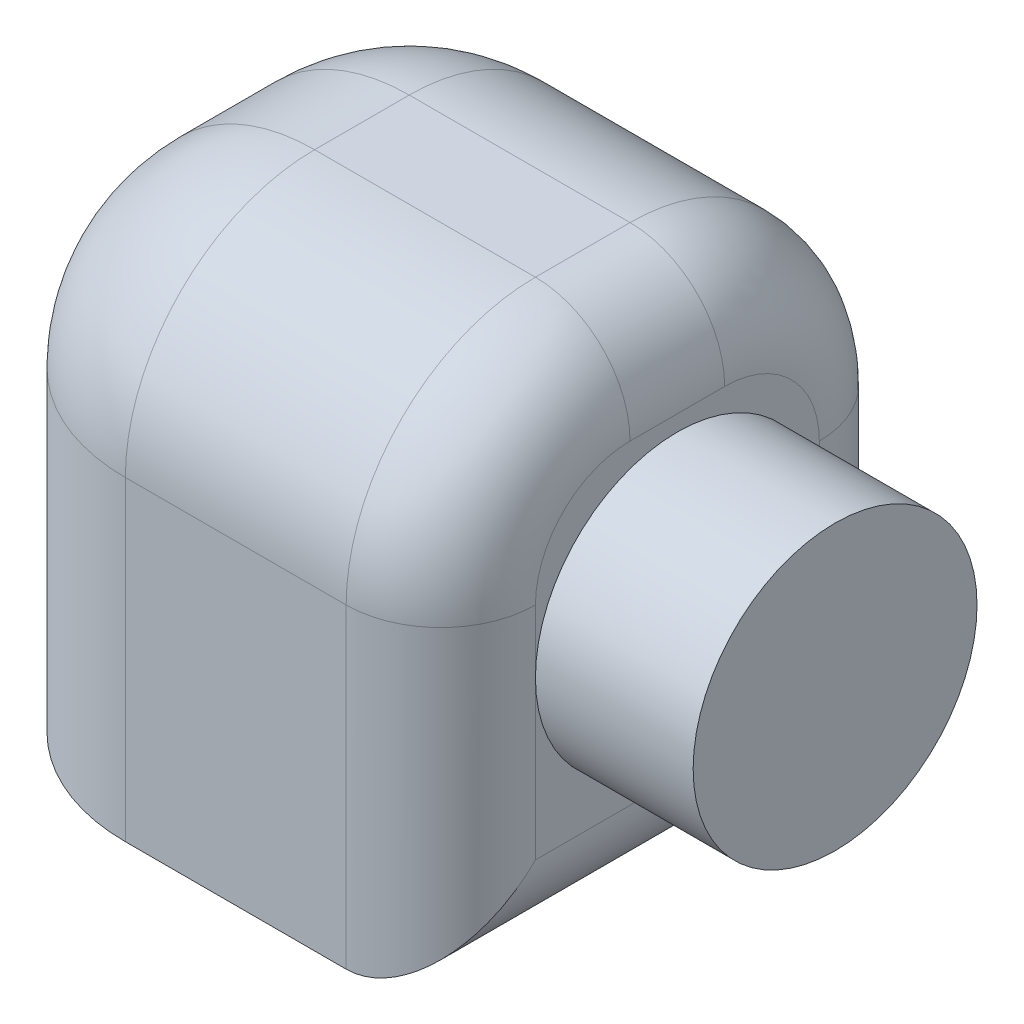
ISO-10303-21;
HEADER;
FILE_DESCRIPTION(('STEP AP214'),'2;1');
FILE_NAME('part.step','',(''),(''),'','','');
FILE_SCHEMA(('AUTOMOTIVE_DESIGN { 1 0 10303 214 1 1 1 1 }'));
ENDSEC;
DATA;
#1=APPLICATION_CONTEXT('core data for automotive mechanical design processes');
#2=APPLICATION_PROTOCOL_DEFINITION('international standard','automotive_design',2000,#1);
#3=PRODUCT_CONTEXT('',#1,'mechanical');
#4=PRODUCT('Part','Part','',(#3));
#5=PRODUCT_RELATED_PRODUCT_CATEGORY('part','',(#4));
#6=PRODUCT_DEFINITION_FORMATION('','',#4);
#7=PRODUCT_DEFINITION_CONTEXT('part definition',#1,'design');
#8=PRODUCT_DEFINITION('design','',#6,#7);
#9=PRODUCT_DEFINITION_SHAPE('','',#8);
#10=(LENGTH_UNIT() NAMED_UNIT(*) SI_UNIT(.MILLI.,.METRE.));
#11=(NAMED_UNIT(*) PLANE_ANGLE_UNIT() SI_UNIT($,.RADIAN.));
#12=(NAMED_UNIT(*) SI_UNIT($,.STERADIAN.) SOLID_ANGLE_UNIT());
#13=UNCERTAINTY_MEASURE_WITH_UNIT(LENGTH_MEASURE(1.E-05),#10,'distance_accuracy_value','');
#14=(GEOMETRIC_REPRESENTATION_CONTEXT(3) GLOBAL_UNCERTAINTY_ASSIGNED_CONTEXT((#13)) GLOBAL_UNIT_ASSIGNED_CONTEXT((#10,
#11,#12)) REPRESENTATION_CONTEXT('',''));
#15=CARTESIAN_POINT('',(0.,0.,0.));
#16=DIRECTION('',(0.,0.,1.));
#17=DIRECTION('',(1.,0.,0.));
#18=AXIS2_PLACEMENT_3D('',#15,#16,#17);
#19=CARTESIAN_POINT('',(160.,160.,0.));
#20=DIRECTION('',(-1.,0.,0.));
#21=DIRECTION('',(0.,0.,1.));
#22=AXIS2_PLACEMENT_3D('',#19,#20,#21);
#23=PLANE('',#22);
#24=CARTESIAN_POINT('',(160.,80.,-75.));
#25=DIRECTION('',(1.,0.,0.));
#26=DIRECTION('',(0.,0.,-1.));
#27=AXIS2_PLACEMENT_3D('',#24,#25,#26);
#28=CIRCLE('',#27,45.);
#29=CARTESIAN_POINT('',(160.,80.,-30.));
#30=VERTEX_POINT('',#29);
#31=CARTESIAN_POINT('',(160.,80.,-120.));
#32=VERTEX_POINT('',#31);
#33=EDGE_CURVE('E250',#30,#32,#28,.T.);
#34=ORIENTED_EDGE('',*,*,#33,.F.);
#35=DIRECTION('',(0.,-1.,0.));
#36=VECTOR('',#35,1.);
#37=CARTESIAN_POINT('',(160.,160.,-30.));
#38=LINE('',#37,#36);
#39=CARTESIAN_POINT('',(160.,30.,-30.));
#40=VERTEX_POINT('',#39);
#41=EDGE_CURVE('E206',#30,#40,#38,.T.);
#42=ORIENTED_EDGE('',*,*,#41,.T.);
#43=DIRECTION('',(0.,0.,-1.));
#44=VECTOR('',#43,1.);
#45=CARTESIAN_POINT('',(160.,30.,-150.));
#46=LINE('',#45,#44);
#47=CARTESIAN_POINT('',(160.,30.,-120.));
#48=VERTEX_POINT('',#47);
#49=EDGE_CURVE('E178',#40,#48,#46,.T.);
#50=ORIENTED_EDGE('',*,*,#49,.T.);
#51=DIRECTION('',(0.,-1.,0.));
#52=VECTOR('',#51,1.);
#53=CARTESIAN_POINT('',(160.,160.,-120.));
#54=LINE('',#53,#52);
#55=EDGE_CURVE('E195',#48,#32,#54,.F.);
#56=ORIENTED_EDGE('',*,*,#55,.T.);
#57=EDGE_LOOP('',(#34,#42,#50,#56));
#58=FACE_BOUND('',#57,.T.);
#59=ADVANCED_FACE('F36',(#58),#23,.F.);
#60=CARTESIAN_POINT('',(0.,160.,0.));
#61=DIRECTION('',(1.,0.,0.));
#62=DIRECTION('',(0.,0.,-1.));
#63=AXIS2_PLACEMENT_3D('',#60,#61,#62);
#64=PLANE('',#63);
#65=DIRECTION('',(0.,0.,1.));
#66=VECTOR('',#65,1.);
#67=CARTESIAN_POINT('',(0.,100.,0.));
#68=LINE('',#67,#66);
#69=CARTESIAN_POINT('',(0.,100.,-60.));
#70=VERTEX_POINT('',#69);
#71=CARTESIAN_POINT('',(0.,100.,-90.));
#72=VERTEX_POINT('',#71);
#73=EDGE_CURVE('E136',#70,#72,#68,.F.);
#74=ORIENTED_EDGE('',*,*,#73,.T.);
#75=DIRECTION('',(0.,-1.,0.));
#76=VECTOR('',#75,1.);
#77=CARTESIAN_POINT('',(0.,160.,-90.));
#78=LINE('',#77,#76);
#79=CARTESIAN_POINT('',(0.,0.,-90.));
#80=VERTEX_POINT('',#79);
#81=EDGE_CURVE('E164',#72,#80,#78,.T.);
#82=ORIENTED_EDGE('',*,*,#81,.T.);
#83=DIRECTION('',(0.,0.,1.));
#84=VECTOR('',#83,1.);
#85=CARTESIAN_POINT('',(0.,0.,0.));
#86=LINE('',#85,#84);
#87=CARTESIAN_POINT('',(0.,0.,-60.));
#88=VERTEX_POINT('',#87);
#89=EDGE_CURVE('E280',#80,#88,#86,.T.);
#90=ORIENTED_EDGE('',*,*,#89,.T.);
#91=DIRECTION('',(0.,-1.,0.));
#92=VECTOR('',#91,1.);
#93=CARTESIAN_POINT('',(0.,160.,-60.));
#94=LINE('',#93,#92);
#95=EDGE_CURVE('E158',#88,#70,#94,.F.);
#96=ORIENTED_EDGE('',*,*,#95,.T.);
#97=EDGE_LOOP('',(#74,#82,#90,#96));
#98=FACE_BOUND('',#97,.T.);
#99=ADVANCED_FACE('F279',(#98),#64,.F.);
#100=CARTESIAN_POINT('',(0.,160.,0.));
#101=DIRECTION('',(0.,0.,-1.));
#102=DIRECTION('',(-1.,0.,0.));
#103=AXIS2_PLACEMENT_3D('',#100,#101,#102);
#104=PLANE('',#103);
#105=DIRECTION('',(1.,0.,0.));
#106=VECTOR('',#105,1.);
#107=CARTESIAN_POINT('',(0.,0.,0.));
#108=LINE('',#107,#106);
#109=CARTESIAN_POINT('',(60.,0.,0.));
#110=VERTEX_POINT('',#109);
#111=CARTESIAN_POINT('',(130.,0.,0.));
#112=VERTEX_POINT('',#111);
#113=EDGE_CURVE('E251',#110,#112,#108,.T.);
#114=ORIENTED_EDGE('',*,*,#113,.T.);
#115=DIRECTION('',(0.,-1.,0.));
#116=VECTOR('',#115,1.);
#117=CARTESIAN_POINT('',(130.,160.,0.));
#118=LINE('',#117,#116);
#119=CARTESIAN_POINT('',(130.,100.,0.));
#120=VERTEX_POINT('',#119);
#121=EDGE_CURVE('E212',#112,#120,#118,.F.);
#122=ORIENTED_EDGE('',*,*,#121,.T.);
#123=DIRECTION('',(1.,0.,0.));
#124=VECTOR('',#123,1.);
#125=CARTESIAN_POINT('',(0.,100.,0.));
#126=LINE('',#125,#124);
#127=CARTESIAN_POINT('',(60.,100.,0.));
#128=VERTEX_POINT('',#127);
#129=EDGE_CURVE('E177',#120,#128,#126,.F.);
#130=ORIENTED_EDGE('',*,*,#129,.T.);
#131=DIRECTION('',(0.,-1.,0.));
#132=VECTOR('',#131,1.);
#133=CARTESIAN_POINT('',(60.,160.,0.));
#134=LINE('',#133,#132);
#135=EDGE_CURVE('E175',#128,#110,#134,.T.);
#136=ORIENTED_EDGE('',*,*,#135,.T.);
#137=EDGE_LOOP('',(#114,#122,#130,#136));
#138=FACE_BOUND('',#137,.T.);
#139=ADVANCED_FACE('F262',(#138),#104,.F.);
#140=CARTESIAN_POINT('',(160.,100.,-60.));
#141=DIRECTION('',(-1.,0.,0.));
#142=DIRECTION('',(0.,0.,1.));
#143=AXIS2_PLACEMENT_3D('',#140,#141,#142);
#144=CIRCLE('',#143,30.);
#145=CARTESIAN_POINT('',(160.,130.,-60.));
#146=VERTEX_POINT('',#145);
#147=CARTESIAN_POINT('',(160.,100.,-30.));
#148=VERTEX_POINT('',#147);
#149=EDGE_CURVE('E201',#146,#148,#144,.F.);
#150=ORIENTED_EDGE('',*,*,#149,.T.);
#151=DIRECTION('',(0.,-1.,0.));
#152=VECTOR('',#151,1.);
#153=CARTESIAN_POINT('',(160.,160.,-30.));
#154=LINE('',#153,#152);
#155=EDGE_CURVE('E203',#148,#30,#154,.T.);
#156=ORIENTED_EDGE('',*,*,#155,.T.);
#157=EDGE_CURVE('E152',#32,#30,#28,.T.);
#158=ORIENTED_EDGE('',*,*,#157,.F.);
#159=DIRECTION('',(0.,-1.,0.));
#160=VECTOR('',#159,1.);
#161=CARTESIAN_POINT('',(160.,160.,-120.));
#162=LINE('',#161,#160);
#163=CARTESIAN_POINT('',(160.,100.,-120.));
#164=VERTEX_POINT('',#163);
#165=EDGE_CURVE('E193',#32,#164,#162,.F.);
#166=ORIENTED_EDGE('',*,*,#165,.T.);
#167=CARTESIAN_POINT('',(160.,100.,-90.));
#168=DIRECTION('',(-1.,0.,0.));
#169=DIRECTION('',(0.,0.,1.));
#170=AXIS2_PLACEMENT_3D('',#167,#168,#169);
#171=CIRCLE('',#170,30.);
#172=CARTESIAN_POINT('',(160.,130.,-90.));
#173=VERTEX_POINT('',#172);
#174=EDGE_CURVE('E197',#164,#173,#171,.F.);
#175=ORIENTED_EDGE('',*,*,#174,.T.);
#176=DIRECTION('',(0.,0.,-1.));
#177=VECTOR('',#176,1.);
#178=CARTESIAN_POINT('',(160.,130.,0.));
#179=LINE('',#178,#177);
#180=EDGE_CURVE('E199',#173,#146,#179,.F.);
#181=ORIENTED_EDGE('',*,*,#180,.T.);
#182=EDGE_LOOP('',(#150,#156,#158,#166,#175,#181));
#183=FACE_BOUND('',#182,.T.);
#184=ADVANCED_FACE('F320',(#183),#23,.F.);
#185=CARTESIAN_POINT('',(0.,160.,-150.));
#186=DIRECTION('',(0.,0.,1.));
#187=DIRECTION('',(1.,0.,0.));
#188=AXIS2_PLACEMENT_3D('',#185,#186,#187);
#189=PLANE('',#188);
#190=DIRECTION('',(-1.,0.,0.));
#191=VECTOR('',#190,1.);
#192=CARTESIAN_POINT('',(0.,100.,-150.));
#193=LINE('',#192,#191);
#194=CARTESIAN_POINT('',(60.,100.,-150.));
#195=VERTEX_POINT('',#194);
#196=CARTESIAN_POINT('',(130.,100.,-150.));
#197=VERTEX_POINT('',#196);
#198=EDGE_CURVE('E168',#195,#197,#193,.F.);
#199=ORIENTED_EDGE('',*,*,#198,.T.);
#200=DIRECTION('',(0.,-1.,0.));
#201=VECTOR('',#200,1.);
#202=CARTESIAN_POINT('',(130.,160.,-150.));
#203=LINE('',#202,#201);
#204=CARTESIAN_POINT('',(130.,0.,-150.));
#205=VERTEX_POINT('',#204);
#206=EDGE_CURVE('E11',#197,#205,#203,.T.);
#207=ORIENTED_EDGE('',*,*,#206,.T.);
#208=DIRECTION('',(-1.,0.,0.));
#209=VECTOR('',#208,1.);
#210=CARTESIAN_POINT('',(0.,0.,-150.));
#211=LINE('',#210,#209);
#212=CARTESIAN_POINT('',(60.,0.,-150.));
#213=VERTEX_POINT('',#212);
#214=EDGE_CURVE('E241',#205,#213,#211,.T.);
#215=ORIENTED_EDGE('',*,*,#214,.T.);
#216=DIRECTION('',(0.,-1.,0.));
#217=VECTOR('',#216,1.);
#218=CARTESIAN_POINT('',(60.,160.,-150.));
#219=LINE('',#218,#217);
#220=EDGE_CURVE('E166',#213,#195,#219,.F.);
#221=ORIENTED_EDGE('',*,*,#220,.T.);
#222=EDGE_LOOP('',(#199,#207,#215,#221));
#223=FACE_BOUND('',#222,.T.);
#224=ADVANCED_FACE('F240',(#223),#189,.F.);
#225=CARTESIAN_POINT('',(0.,160.,0.));
#226=DIRECTION('',(0.,-1.,0.));
#227=DIRECTION('',(0.,0.,-1.));
#228=AXIS2_PLACEMENT_3D('',#225,#226,#227);
#229=PLANE('',#228);
#230=DIRECTION('',(1.,0.,0.));
#231=VECTOR('',#230,1.);
#232=CARTESIAN_POINT('',(0.,160.,-60.));
#233=LINE('',#232,#231);
#234=CARTESIAN_POINT('',(60.,160.,-60.));
#235=VERTEX_POINT('',#234);
#236=CARTESIAN_POINT('',(130.,160.,-60.));
#237=VERTEX_POINT('',#236);
#238=EDGE_CURVE('E148',#235,#237,#233,.T.);
#239=ORIENTED_EDGE('',*,*,#238,.T.);
#240=DIRECTION('',(0.,0.,-1.));
#241=VECTOR('',#240,1.);
#242=CARTESIAN_POINT('',(130.,160.,0.));
#243=LINE('',#242,#241);
#244=CARTESIAN_POINT('',(130.,160.,-90.));
#245=VERTEX_POINT('',#244);
#246=EDGE_CURVE('E214',#237,#245,#243,.T.);
#247=ORIENTED_EDGE('',*,*,#246,.T.);
#248=DIRECTION('',(-1.,0.,0.));
#249=VECTOR('',#248,1.);
#250=CARTESIAN_POINT('',(0.,160.,-90.));
#251=LINE('',#250,#249);
#252=CARTESIAN_POINT('',(60.,160.,-90.));
#253=VERTEX_POINT('',#252);
#254=EDGE_CURVE('E155',#245,#253,#251,.T.);
#255=ORIENTED_EDGE('',*,*,#254,.T.);
#256=DIRECTION('',(0.,0.,1.));
#257=VECTOR('',#256,1.);
#258=CARTESIAN_POINT('',(60.,160.,0.));
#259=LINE('',#258,#257);
#260=EDGE_CURVE('E135',#253,#235,#259,.T.);
#261=ORIENTED_EDGE('',*,*,#260,.T.);
#262=EDGE_LOOP('',(#239,#247,#255,#261));
#263=FACE_BOUND('',#262,.T.);
#264=ADVANCED_FACE('F154',(#263),#229,.F.);
#265=CARTESIAN_POINT('',(0.,0.,0.));
#266=DIRECTION('',(0.,-1.,0.));
#267=DIRECTION('',(0.,0.,-1.));
#268=AXIS2_PLACEMENT_3D('',#265,#266,#267);
#269=PLANE('',#268);
#270=CARTESIAN_POINT('',(80.,0.,-75.));
#271=DIRECTION('',(0.,-1.,0.));
#272=DIRECTION('',(0.,0.,-1.));
#273=AXIS2_PLACEMENT_3D('',#270,#271,#272);
#274=CIRCLE('',#273,45.);
#275=CARTESIAN_POINT('',(80.,0.,-120.));
#276=VERTEX_POINT('',#275);
#277=EDGE_CURVE('E187',#276,#276,#274,.T.);
#278=ORIENTED_EDGE('',*,*,#277,.F.);
#279=EDGE_LOOP('',(#278));
#280=FACE_BOUND('',#279,.T.);
#281=ORIENTED_EDGE('',*,*,#214,.F.);
#282=DIRECTION('',(0.,0.,-1.));
#283=VECTOR('',#282,1.);
#284=CARTESIAN_POINT('',(130.,0.,0.));
#285=LINE('',#284,#283);
#286=EDGE_CURVE('E190',#205,#112,#285,.F.);
#287=ORIENTED_EDGE('',*,*,#286,.T.);
#288=ORIENTED_EDGE('',*,*,#113,.F.);
#289=CARTESIAN_POINT('',(60.,0.,-60.));
#290=DIRECTION('',(0.,-1.,0.));
#291=DIRECTION('',(0.,0.,-1.));
#292=AXIS2_PLACEMENT_3D('',#289,#290,#291);
#293=CIRCLE('',#292,60.);
#294=EDGE_CURVE('E170',#110,#88,#293,.T.);
#295=ORIENTED_EDGE('',*,*,#294,.T.);
#296=ORIENTED_EDGE('',*,*,#89,.F.);
#297=CARTESIAN_POINT('',(60.,0.,-90.));
#298=DIRECTION('',(0.,-1.,0.));
#299=DIRECTION('',(0.,0.,-1.));
#300=AXIS2_PLACEMENT_3D('',#297,#298,#299);
#301=CIRCLE('',#300,60.);
#302=EDGE_CURVE('E172',#80,#213,#301,.T.);
#303=ORIENTED_EDGE('',*,*,#302,.T.);
#304=EDGE_LOOP('',(#281,#287,#288,#295,#296,#303));
#305=FACE_BOUND('',#304,.T.);
#306=ADVANCED_FACE('F244',(#280,#305),#269,.T.);
#307=CARTESIAN_POINT('',(210.,80.,-75.));
#308=DIRECTION('',(-1.,0.,0.));
#309=DIRECTION('',(0.,0.,1.));
#310=AXIS2_PLACEMENT_3D('',#307,#308,#309);
#311=CYLINDRICAL_SURFACE('',#310,45.);
#312=CARTESIAN_POINT('',(210.,80.,-75.));
#313=DIRECTION('',(1.,0.,0.));
#314=DIRECTION('',(0.,0.,-1.));
#315=AXIS2_PLACEMENT_3D('',#312,#313,#314);
#316=CIRCLE('',#315,45.);
#317=CARTESIAN_POINT('',(210.,80.,-120.));
#318=VERTEX_POINT('',#317);
#319=EDGE_CURVE('E283',#318,#318,#316,.T.);
#320=ORIENTED_EDGE('',*,*,#319,.F.);
#321=EDGE_LOOP('',(#320));
#322=FACE_BOUND('',#321,.T.);
#323=ORIENTED_EDGE('',*,*,#157,.T.);
#324=ORIENTED_EDGE('',*,*,#33,.T.);
#325=EDGE_LOOP('',(#323,#324));
#326=FACE_BOUND('',#325,.T.);
#327=ADVANCED_FACE('F307',(#322,#326),#311,.T.);
#328=CARTESIAN_POINT('',(210.,80.,-75.));
#329=DIRECTION('',(1.,0.,0.));
#330=DIRECTION('',(0.,0.,-1.));
#331=AXIS2_PLACEMENT_3D('',#328,#329,#330);
#332=PLANE('',#331);
#333=ORIENTED_EDGE('',*,*,#319,.T.);
#334=EDGE_LOOP('',(#333));
#335=FACE_BOUND('',#334,.T.);
#336=ADVANCED_FACE('F302',(#335),#332,.T.);
#337=CARTESIAN_POINT('',(80.,50.,-75.));
#338=DIRECTION('',(0.,-1.,0.));
#339=DIRECTION('',(0.,0.,-1.));
#340=AXIS2_PLACEMENT_3D('',#337,#338,#339);
#341=CYLINDRICAL_SURFACE('',#340,45.);
#342=CARTESIAN_POINT('',(80.,50.,-75.));
#343=DIRECTION('',(0.,-1.,0.));
#344=DIRECTION('',(0.,0.,-1.));
#345=AXIS2_PLACEMENT_3D('',#342,#343,#344);
#346=CIRCLE('',#345,45.);
#347=CARTESIAN_POINT('',(80.,50.,-120.));
#348=VERTEX_POINT('',#347);
#349=EDGE_CURVE('E287',#348,#348,#346,.T.);
#350=ORIENTED_EDGE('',*,*,#349,.F.);
#351=EDGE_LOOP('',(#350));
#352=FACE_BOUND('',#351,.T.);
#353=ORIENTED_EDGE('',*,*,#277,.T.);
#354=EDGE_LOOP('',(#353));
#355=FACE_BOUND('',#354,.T.);
#356=ADVANCED_FACE('F299',(#352,#355),#341,.F.);
#357=CARTESIAN_POINT('',(80.,50.,-75.));
#358=DIRECTION('',(0.,-1.,0.));
#359=DIRECTION('',(0.,0.,-1.));
#360=AXIS2_PLACEMENT_3D('',#357,#358,#359);
#361=PLANE('',#360);
#362=ORIENTED_EDGE('',*,*,#349,.T.);
#363=EDGE_LOOP('',(#362));
#364=FACE_BOUND('',#363,.T.);
#365=ADVANCED_FACE('F297',(#364),#361,.T.);
#366=CARTESIAN_POINT('',(60.,160.,-90.));
#367=DIRECTION('',(0.,-1.,0.));
#368=DIRECTION('',(0.,0.,-1.));
#369=AXIS2_PLACEMENT_3D('',#366,#367,#368);
#370=CYLINDRICAL_SURFACE('',#369,60.);
#371=ORIENTED_EDGE('',*,*,#302,.F.);
#372=ORIENTED_EDGE('',*,*,#81,.F.);
#373=CARTESIAN_POINT('',(60.,100.,-90.));
#374=DIRECTION('',(0.,1.,0.));
#375=DIRECTION('',(0.,0.,1.));
#376=AXIS2_PLACEMENT_3D('',#373,#374,#375);
#377=CIRCLE('',#376,60.);
#378=EDGE_CURVE('E184',#195,#72,#377,.T.);
#379=ORIENTED_EDGE('',*,*,#378,.F.);
#380=ORIENTED_EDGE('',*,*,#220,.F.);
#381=EDGE_LOOP('',(#371,#372,#379,#380));
#382=FACE_BOUND('',#381,.T.);
#383=ADVANCED_FACE('F276',(#382),#370,.T.);
#384=CARTESIAN_POINT('',(0.,100.,-90.));
#385=DIRECTION('',(-1.,0.,0.));
#386=DIRECTION('',(0.,0.,1.));
#387=AXIS2_PLACEMENT_3D('',#384,#385,#386);
#388=CYLINDRICAL_SURFACE('',#387,60.);
#389=ORIENTED_EDGE('',*,*,#254,.F.);
#390=CARTESIAN_POINT('',(130.,100.,-90.));
#391=DIRECTION('',(-1.,0.,0.));
#392=DIRECTION('',(0.,0.,1.));
#393=AXIS2_PLACEMENT_3D('',#390,#391,#392);
#394=CIRCLE('',#393,60.);
#395=EDGE_CURVE('E45',#245,#197,#394,.T.);
#396=ORIENTED_EDGE('',*,*,#395,.T.);
#397=ORIENTED_EDGE('',*,*,#198,.F.);
#398=CARTESIAN_POINT('',(60.,100.,-90.));
#399=DIRECTION('',(-1.,0.,0.));
#400=DIRECTION('',(0.,0.,1.));
#401=AXIS2_PLACEMENT_3D('',#398,#399,#400);
#402=CIRCLE('',#401,60.);
#403=EDGE_CURVE('E146',#253,#195,#402,.T.);
#404=ORIENTED_EDGE('',*,*,#403,.F.);
#405=EDGE_LOOP('',(#389,#396,#397,#404));
#406=FACE_BOUND('',#405,.T.);
#407=ADVANCED_FACE('F269',(#406),#388,.T.);
#408=CARTESIAN_POINT('',(0.,100.,-60.));
#409=DIRECTION('',(1.,0.,0.));
#410=DIRECTION('',(0.,0.,-1.));
#411=AXIS2_PLACEMENT_3D('',#408,#409,#410);
#412=CYLINDRICAL_SURFACE('',#411,60.);
#413=ORIENTED_EDGE('',*,*,#129,.F.);
#414=CARTESIAN_POINT('',(130.,100.,-60.));
#415=DIRECTION('',(-1.,0.,0.));
#416=DIRECTION('',(0.,0.,1.));
#417=AXIS2_PLACEMENT_3D('',#414,#415,#416);
#418=CIRCLE('',#417,60.);
#419=EDGE_CURVE('E60',#120,#237,#418,.T.);
#420=ORIENTED_EDGE('',*,*,#419,.T.);
#421=ORIENTED_EDGE('',*,*,#238,.F.);
#422=CARTESIAN_POINT('',(60.,100.,-60.));
#423=DIRECTION('',(-1.,0.,0.));
#424=DIRECTION('',(0.,0.,1.));
#425=AXIS2_PLACEMENT_3D('',#422,#423,#424);
#426=CIRCLE('',#425,60.);
#427=EDGE_CURVE('E142',#128,#235,#426,.T.);
#428=ORIENTED_EDGE('',*,*,#427,.F.);
#429=EDGE_LOOP('',(#413,#420,#421,#428));
#430=FACE_BOUND('',#429,.T.);
#431=ADVANCED_FACE('F149',(#430),#412,.T.);
#432=CARTESIAN_POINT('',(60.,160.,-60.));
#433=DIRECTION('',(0.,-1.,0.));
#434=DIRECTION('',(0.,0.,-1.));
#435=AXIS2_PLACEMENT_3D('',#432,#433,#434);
#436=CYLINDRICAL_SURFACE('',#435,60.);
#437=ORIENTED_EDGE('',*,*,#294,.F.);
#438=ORIENTED_EDGE('',*,*,#135,.F.);
#439=CARTESIAN_POINT('',(60.,100.,-60.));
#440=DIRECTION('',(0.,1.,0.));
#441=DIRECTION('',(0.,0.,1.));
#442=AXIS2_PLACEMENT_3D('',#439,#440,#441);
#443=CIRCLE('',#442,60.);
#444=EDGE_CURVE('E145',#70,#128,#443,.T.);
#445=ORIENTED_EDGE('',*,*,#444,.F.);
#446=ORIENTED_EDGE('',*,*,#95,.F.);
#447=EDGE_LOOP('',(#437,#438,#445,#446));
#448=FACE_BOUND('',#447,.T.);
#449=ADVANCED_FACE('F345',(#448),#436,.T.);
#450=CARTESIAN_POINT('',(60.,100.,-90.));
#451=DIRECTION('',(0.,0.,1.));
#452=DIRECTION('',(1.,0.,0.));
#453=AXIS2_PLACEMENT_3D('',#450,#451,#452);
#454=SPHERICAL_SURFACE('',#453,60.);
#455=ORIENTED_EDGE('',*,*,#403,.T.);
#456=ORIENTED_EDGE('',*,*,#378,.T.);
#457=CARTESIAN_POINT('',(60.,100.,-90.));
#458=DIRECTION('',(0.,0.,-1.));
#459=DIRECTION('',(-1.,0.,0.));
#460=AXIS2_PLACEMENT_3D('',#457,#458,#459);
#461=CIRCLE('',#460,60.);
#462=EDGE_CURVE('E139',#253,#72,#461,.F.);
#463=ORIENTED_EDGE('',*,*,#462,.F.);
#464=EDGE_LOOP('',(#455,#456,#463));
#465=FACE_BOUND('',#464,.T.);
#466=ADVANCED_FACE('F273',(#465),#454,.T.);
#467=CARTESIAN_POINT('',(60.,100.,-60.));
#468=DIRECTION('',(0.,0.,1.));
#469=DIRECTION('',(1.,0.,0.));
#470=AXIS2_PLACEMENT_3D('',#467,#468,#469);
#471=SPHERICAL_SURFACE('',#470,60.);
#472=ORIENTED_EDGE('',*,*,#444,.T.);
#473=ORIENTED_EDGE('',*,*,#427,.T.);
#474=CARTESIAN_POINT('',(60.,100.,-60.));
#475=DIRECTION('',(0.,0.,1.));
#476=DIRECTION('',(1.,0.,0.));
#477=AXIS2_PLACEMENT_3D('',#474,#475,#476);
#478=CIRCLE('',#477,60.);
#479=EDGE_CURVE('E130',#70,#235,#478,.F.);
#480=ORIENTED_EDGE('',*,*,#479,.F.);
#481=EDGE_LOOP('',(#472,#473,#480));
#482=FACE_BOUND('',#481,.T.);
#483=ADVANCED_FACE('F143',(#482),#471,.T.);
#484=CARTESIAN_POINT('',(60.,100.,0.));
#485=DIRECTION('',(0.,0.,1.));
#486=DIRECTION('',(1.,0.,0.));
#487=AXIS2_PLACEMENT_3D('',#484,#485,#486);
#488=CYLINDRICAL_SURFACE('',#487,60.);
#489=ORIENTED_EDGE('',*,*,#462,.T.);
#490=ORIENTED_EDGE('',*,*,#73,.F.);
#491=ORIENTED_EDGE('',*,*,#479,.T.);
#492=ORIENTED_EDGE('',*,*,#260,.F.);
#493=EDGE_LOOP('',(#489,#490,#491,#492));
#494=FACE_BOUND('',#493,.T.);
#495=ADVANCED_FACE('F133',(#494),#488,.T.);
#496=CARTESIAN_POINT('',(130.,30.,0.));
#497=DIRECTION('',(0.,0.,1.));
#498=DIRECTION('',(1.,0.,0.));
#499=AXIS2_PLACEMENT_3D('',#496,#497,#498);
#500=CYLINDRICAL_SURFACE('',#499,30.);
#501=ORIENTED_EDGE('',*,*,#49,.F.);
#502=CARTESIAN_POINT('',(130.,30.,-30.));
#503=DIRECTION('',(0.,0.707106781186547,0.707106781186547));
#504=DIRECTION('',(0.,-0.707106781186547,0.707106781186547));
#505=AXIS2_PLACEMENT_3D('',#502,#503,#504);
#506=ELLIPSE('',#505,42.4264068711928,30.);
#507=EDGE_CURVE('E210',#40,#112,#506,.F.);
#508=ORIENTED_EDGE('',*,*,#507,.T.);
#509=ORIENTED_EDGE('',*,*,#286,.F.);
#510=CARTESIAN_POINT('',(130.,30.,-120.));
#511=DIRECTION('',(0.,-0.707106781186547,0.707106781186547));
#512=DIRECTION('',(0.,0.707106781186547,0.707106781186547));
#513=AXIS2_PLACEMENT_3D('',#510,#511,#512);
#514=ELLIPSE('',#513,42.4264068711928,30.);
#515=EDGE_CURVE('E208',#205,#48,#514,.T.);
#516=ORIENTED_EDGE('',*,*,#515,.T.);
#517=EDGE_LOOP('',(#501,#508,#509,#516));
#518=FACE_BOUND('',#517,.T.);
#519=ADVANCED_FACE('F254',(#518),#500,.T.);
#520=CARTESIAN_POINT('',(130.,160.,-120.));
#521=DIRECTION('',(0.,-1.,0.));
#522=DIRECTION('',(0.,0.,-1.));
#523=AXIS2_PLACEMENT_3D('',#520,#521,#522);
#524=CYLINDRICAL_SURFACE('',#523,30.);
#525=ORIENTED_EDGE('',*,*,#515,.F.);
#526=ORIENTED_EDGE('',*,*,#206,.F.);
#527=CARTESIAN_POINT('',(130.,100.,-120.));
#528=DIRECTION('',(0.,1.,0.));
#529=DIRECTION('',(0.,0.,1.));
#530=AXIS2_PLACEMENT_3D('',#527,#528,#529);
#531=CIRCLE('',#530,30.);
#532=EDGE_CURVE('E40',#164,#197,#531,.T.);
#533=ORIENTED_EDGE('',*,*,#532,.F.);
#534=ORIENTED_EDGE('',*,*,#165,.F.);
#535=ORIENTED_EDGE('',*,*,#55,.F.);
#536=EDGE_LOOP('',(#525,#526,#533,#534,#535));
#537=FACE_BOUND('',#536,.T.);
#538=ADVANCED_FACE('F38',(#537),#524,.T.);
#539=CARTESIAN_POINT('',(130.,100.,-90.));
#540=DIRECTION('',(-1.,0.,0.));
#541=DIRECTION('',(0.,0.,1.));
#542=AXIS2_PLACEMENT_3D('',#539,#540,#541);
#543=TOROIDAL_SURFACE('',#542,30.,30.);
#544=ORIENTED_EDGE('',*,*,#532,.T.);
#545=ORIENTED_EDGE('',*,*,#395,.F.);
#546=CARTESIAN_POINT('',(130.,130.,-90.));
#547=DIRECTION('',(0.,0.,1.));
#548=DIRECTION('',(1.,0.,0.));
#549=AXIS2_PLACEMENT_3D('',#546,#547,#548);
#550=CIRCLE('',#549,30.);
#551=EDGE_CURVE('E223',#173,#245,#550,.T.);
#552=ORIENTED_EDGE('',*,*,#551,.F.);
#553=ORIENTED_EDGE('',*,*,#174,.F.);
#554=EDGE_LOOP('',(#544,#545,#552,#553));
#555=FACE_BOUND('',#554,.T.);
#556=ADVANCED_FACE('F232',(#555),#543,.T.);
#557=CARTESIAN_POINT('',(130.,130.,0.));
#558=DIRECTION('',(0.,0.,-1.));
#559=DIRECTION('',(-1.,0.,0.));
#560=AXIS2_PLACEMENT_3D('',#557,#558,#559);
#561=CYLINDRICAL_SURFACE('',#560,30.);
#562=ORIENTED_EDGE('',*,*,#551,.T.);
#563=ORIENTED_EDGE('',*,*,#246,.F.);
#564=CARTESIAN_POINT('',(130.,130.,-60.));
#565=DIRECTION('',(0.,0.,1.));
#566=DIRECTION('',(1.,0.,0.));
#567=AXIS2_PLACEMENT_3D('',#564,#565,#566);
#568=CIRCLE('',#567,30.);
#569=EDGE_CURVE('E221',#146,#237,#568,.T.);
#570=ORIENTED_EDGE('',*,*,#569,.F.);
#571=ORIENTED_EDGE('',*,*,#180,.F.);
#572=EDGE_LOOP('',(#562,#563,#570,#571));
#573=FACE_BOUND('',#572,.T.);
#574=ADVANCED_FACE('F268',(#573),#561,.T.);
#575=CARTESIAN_POINT('',(130.,100.,-60.));
#576=DIRECTION('',(-1.,0.,0.));
#577=DIRECTION('',(0.,0.,1.));
#578=AXIS2_PLACEMENT_3D('',#575,#576,#577);
#579=TOROIDAL_SURFACE('',#578,30.,30.);
#580=ORIENTED_EDGE('',*,*,#569,.T.);
#581=ORIENTED_EDGE('',*,*,#419,.F.);
#582=CARTESIAN_POINT('',(130.,100.,-30.));
#583=DIRECTION('',(0.,-1.,0.));
#584=DIRECTION('',(0.,0.,-1.));
#585=AXIS2_PLACEMENT_3D('',#582,#583,#584);
#586=CIRCLE('',#585,30.);
#587=EDGE_CURVE('E218',#148,#120,#586,.T.);
#588=ORIENTED_EDGE('',*,*,#587,.F.);
#589=ORIENTED_EDGE('',*,*,#149,.F.);
#590=EDGE_LOOP('',(#580,#581,#588,#589));
#591=FACE_BOUND('',#590,.T.);
#592=ADVANCED_FACE('F265',(#591),#579,.T.);
#593=CARTESIAN_POINT('',(130.,160.,-30.));
#594=DIRECTION('',(0.,-1.,0.));
#595=DIRECTION('',(0.,0.,-1.));
#596=AXIS2_PLACEMENT_3D('',#593,#594,#595);
#597=CYLINDRICAL_SURFACE('',#596,30.);
#598=ORIENTED_EDGE('',*,*,#587,.T.);
#599=ORIENTED_EDGE('',*,*,#121,.F.);
#600=ORIENTED_EDGE('',*,*,#507,.F.);
#601=ORIENTED_EDGE('',*,*,#41,.F.);
#602=ORIENTED_EDGE('',*,*,#155,.F.);
#603=EDGE_LOOP('',(#598,#599,#600,#601,#602));
#604=FACE_BOUND('',#603,.T.);
#605=ADVANCED_FACE('F258',(#604),#597,.T.);
#606=CLOSED_SHELL('',(#59,#99,#139,#184,#224,#264,#306,#327,#336,#356,#365,#383,#407,#431,#449,
#466,#483,#495,#519,#538,#556,#574,#592,#605));
#607=MANIFOLD_SOLID_BREP('B2',#606);
#608=ADVANCED_BREP_SHAPE_REPRESENTATION('',(#18,#607),#14);
#609=SHAPE_DEFINITION_REPRESENTATION(#9,#608);
ENDSEC;
END-ISO-10303-21;
